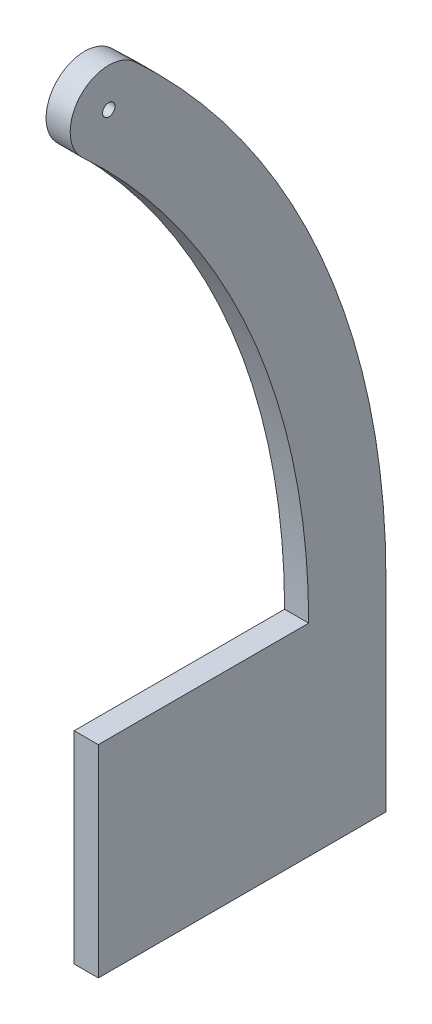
ISO-10303-21;
HEADER;
FILE_DESCRIPTION(('STEP AP214'),'2;1');
FILE_NAME('part.step','',(''),(''),'','','');
FILE_SCHEMA(('AUTOMOTIVE_DESIGN { 1 0 10303 214 1 1 1 1 }'));
ENDSEC;
DATA;
#1=APPLICATION_CONTEXT('core data for automotive mechanical design processes');
#2=APPLICATION_PROTOCOL_DEFINITION('international standard','automotive_design',2000,#1);
#3=PRODUCT_CONTEXT('',#1,'mechanical');
#4=PRODUCT('Part','Part','',(#3));
#5=PRODUCT_RELATED_PRODUCT_CATEGORY('part','',(#4));
#6=PRODUCT_DEFINITION_FORMATION('','',#4);
#7=PRODUCT_DEFINITION_CONTEXT('part definition',#1,'design');
#8=PRODUCT_DEFINITION('design','',#6,#7);
#9=PRODUCT_DEFINITION_SHAPE('','',#8);
#10=(LENGTH_UNIT() NAMED_UNIT(*) SI_UNIT(.MILLI.,.METRE.));
#11=(NAMED_UNIT(*) PLANE_ANGLE_UNIT() SI_UNIT($,.RADIAN.));
#12=(NAMED_UNIT(*) SI_UNIT($,.STERADIAN.) SOLID_ANGLE_UNIT());
#13=UNCERTAINTY_MEASURE_WITH_UNIT(LENGTH_MEASURE(1.E-05),#10,'distance_accuracy_value','');
#14=(GEOMETRIC_REPRESENTATION_CONTEXT(3) GLOBAL_UNCERTAINTY_ASSIGNED_CONTEXT((#13)) GLOBAL_UNIT_ASSIGNED_CONTEXT((#10,
#11,#12)) REPRESENTATION_CONTEXT('',''));
#15=CARTESIAN_POINT('',(0.,0.,0.));
#16=DIRECTION('',(0.,0.,1.));
#17=DIRECTION('',(1.,0.,0.));
#18=AXIS2_PLACEMENT_3D('',#15,#16,#17);
#19=CARTESIAN_POINT('',(6.2,52.,200.555112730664));
#20=DIRECTION('',(-1.,0.,0.));
#21=DIRECTION('',(0.,0.,1.));
#22=AXIS2_PLACEMENT_3D('',#19,#20,#21);
#23=PLANE('',#22);
#24=CARTESIAN_POINT('',(6.2,52.,200.555112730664));
#25=DIRECTION('',(1.,0.,0.));
#26=DIRECTION('',(0.,0.,1.));
#27=AXIS2_PLACEMENT_3D('',#24,#25,#26);
#28=CIRCLE('',#27,200.555112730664);
#29=CARTESIAN_POINT('',(6.2,52.,0.));
#30=VERTEX_POINT('',#29);
#31=CARTESIAN_POINT('',(6.2,199.405279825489,64.5623308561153));
#32=VERTEX_POINT('',#31);
#33=EDGE_CURVE('E138',#30,#32,#28,.T.);
#34=ORIENTED_EDGE('',*,*,#33,.T.);
#35=CARTESIAN_POINT('',(6.2,192.103857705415,71.2984579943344));
#36=DIRECTION('',(1.,0.,0.));
#37=DIRECTION('',(0.,0.,1.));
#38=AXIS2_PLACEMENT_3D('',#35,#36,#37);
#39=CIRCLE('',#38,9.9340914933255);
#40=CARTESIAN_POINT('',(6.2,184.802435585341,78.0345851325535));
#41=VERTEX_POINT('',#40);
#42=EDGE_CURVE('E91',#32,#41,#39,.T.);
#43=ORIENTED_EDGE('',*,*,#42,.T.);
#44=CARTESIAN_POINT('',(6.2,52.,200.555112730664));
#45=DIRECTION('',(-1.,0.,0.));
#46=DIRECTION('',(0.,0.,-1.));
#47=AXIS2_PLACEMENT_3D('',#44,#45,#46);
#48=CIRCLE('',#47,180.686929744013);
#49=CARTESIAN_POINT('',(6.2,52.,19.868182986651));
#50=VERTEX_POINT('',#49);
#51=EDGE_CURVE('E150',#41,#50,#48,.T.);
#52=ORIENTED_EDGE('',*,*,#51,.T.);
#53=DIRECTION('',(0.,0.,1.));
#54=VECTOR('',#53,1.);
#55=CARTESIAN_POINT('',(6.2,52.,74.));
#56=LINE('',#55,#54);
#57=CARTESIAN_POINT('',(6.2,52.,74.));
#58=VERTEX_POINT('',#57);
#59=EDGE_CURVE('E107',#50,#58,#56,.T.);
#60=ORIENTED_EDGE('',*,*,#59,.T.);
#61=DIRECTION('',(0.,-1.,0.));
#62=VECTOR('',#61,1.);
#63=CARTESIAN_POINT('',(6.2,0.,74.));
#64=LINE('',#63,#62);
#65=CARTESIAN_POINT('',(6.2,0.,74.));
#66=VERTEX_POINT('',#65);
#67=EDGE_CURVE('E101',#58,#66,#64,.T.);
#68=ORIENTED_EDGE('',*,*,#67,.T.);
#69=DIRECTION('',(0.,0.,-1.));
#70=VECTOR('',#69,1.);
#71=CARTESIAN_POINT('',(6.2,0.,0.));
#72=LINE('',#71,#70);
#73=CARTESIAN_POINT('',(6.2,0.,0.));
#74=VERTEX_POINT('',#73);
#75=EDGE_CURVE('E105',#66,#74,#72,.T.);
#76=ORIENTED_EDGE('',*,*,#75,.T.);
#77=DIRECTION('',(0.,1.,0.));
#78=VECTOR('',#77,1.);
#79=CARTESIAN_POINT('',(6.2,52.,0.));
#80=LINE('',#79,#78);
#81=EDGE_CURVE('E51',#74,#30,#80,.T.);
#82=ORIENTED_EDGE('',*,*,#81,.T.);
#83=EDGE_LOOP('',(#34,#43,#52,#60,#68,#76,#82));
#84=FACE_BOUND('',#83,.T.);
#85=CARTESIAN_POINT('',(6.2,192.103857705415,71.2984579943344));
#86=DIRECTION('',(1.,0.,0.));
#87=DIRECTION('',(0.,0.,-1.));
#88=AXIS2_PLACEMENT_3D('',#85,#86,#87);
#89=CIRCLE('',#88,1.6);
#90=CARTESIAN_POINT('',(6.2,192.103857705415,72.8984579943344));
#91=VERTEX_POINT('',#90);
#92=EDGE_CURVE('E129',#91,#91,#89,.T.);
#93=ORIENTED_EDGE('',*,*,#92,.F.);
#94=EDGE_LOOP('',(#93));
#95=FACE_BOUND('',#94,.T.);
#96=ADVANCED_FACE('F34',(#84,#95),#23,.F.);
#97=CARTESIAN_POINT('',(0.,52.,200.555112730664));
#98=DIRECTION('',(-1.,0.,0.));
#99=DIRECTION('',(0.,0.,1.));
#100=AXIS2_PLACEMENT_3D('',#97,#98,#99);
#101=PLANE('',#100);
#102=CARTESIAN_POINT('',(0.,52.,200.555112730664));
#103=DIRECTION('',(1.,0.,0.));
#104=DIRECTION('',(0.,0.,1.));
#105=AXIS2_PLACEMENT_3D('',#102,#103,#104);
#106=CIRCLE('',#105,200.555112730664);
#107=CARTESIAN_POINT('',(0.,52.,0.));
#108=VERTEX_POINT('',#107);
#109=CARTESIAN_POINT('',(0.,199.405279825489,64.5623308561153));
#110=VERTEX_POINT('',#109);
#111=EDGE_CURVE('E125',#108,#110,#106,.T.);
#112=ORIENTED_EDGE('',*,*,#111,.F.);
#113=DIRECTION('',(0.,1.,0.));
#114=VECTOR('',#113,1.);
#115=CARTESIAN_POINT('',(0.,52.,0.));
#116=LINE('',#115,#114);
#117=CARTESIAN_POINT('',(0.,0.,0.));
#118=VERTEX_POINT('',#117);
#119=EDGE_CURVE('E83',#118,#108,#116,.T.);
#120=ORIENTED_EDGE('',*,*,#119,.F.);
#121=DIRECTION('',(0.,0.,-1.));
#122=VECTOR('',#121,1.);
#123=CARTESIAN_POINT('',(0.,0.,0.));
#124=LINE('',#123,#122);
#125=CARTESIAN_POINT('',(0.,0.,74.));
#126=VERTEX_POINT('',#125);
#127=EDGE_CURVE('E77',#126,#118,#124,.T.);
#128=ORIENTED_EDGE('',*,*,#127,.F.);
#129=DIRECTION('',(0.,-1.,0.));
#130=VECTOR('',#129,1.);
#131=CARTESIAN_POINT('',(0.,0.,74.));
#132=LINE('',#131,#130);
#133=CARTESIAN_POINT('',(0.,52.,74.));
#134=VERTEX_POINT('',#133);
#135=EDGE_CURVE('E115',#134,#126,#132,.T.);
#136=ORIENTED_EDGE('',*,*,#135,.F.);
#137=DIRECTION('',(0.,0.,1.));
#138=VECTOR('',#137,1.);
#139=CARTESIAN_POINT('',(0.,52.,74.));
#140=LINE('',#139,#138);
#141=CARTESIAN_POINT('',(0.,52.,19.868182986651));
#142=VERTEX_POINT('',#141);
#143=EDGE_CURVE('E133',#142,#134,#140,.T.);
#144=ORIENTED_EDGE('',*,*,#143,.F.);
#145=CARTESIAN_POINT('',(0.,52.,200.555112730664));
#146=DIRECTION('',(-1.,0.,0.));
#147=DIRECTION('',(0.,0.,-1.));
#148=AXIS2_PLACEMENT_3D('',#145,#146,#147);
#149=CIRCLE('',#148,180.686929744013);
#150=CARTESIAN_POINT('',(0.,184.802435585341,78.0345851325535));
#151=VERTEX_POINT('',#150);
#152=EDGE_CURVE('E131',#151,#142,#149,.T.);
#153=ORIENTED_EDGE('',*,*,#152,.F.);
#154=CARTESIAN_POINT('',(0.,192.103857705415,71.2984579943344));
#155=DIRECTION('',(1.,0.,0.));
#156=DIRECTION('',(0.,0.,1.));
#157=AXIS2_PLACEMENT_3D('',#154,#155,#156);
#158=CIRCLE('',#157,9.9340914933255);
#159=EDGE_CURVE('E128',#110,#151,#158,.T.);
#160=ORIENTED_EDGE('',*,*,#159,.F.);
#161=EDGE_LOOP('',(#112,#120,#128,#136,#144,#153,#160));
#162=FACE_BOUND('',#161,.T.);
#163=CARTESIAN_POINT('',(0.,192.103857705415,71.2984579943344));
#164=DIRECTION('',(1.,0.,0.));
#165=DIRECTION('',(0.,0.,-1.));
#166=AXIS2_PLACEMENT_3D('',#163,#164,#165);
#167=CIRCLE('',#166,1.6);
#168=CARTESIAN_POINT('',(0.,192.103857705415,72.8984579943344));
#169=VERTEX_POINT('',#168);
#170=EDGE_CURVE('E162',#169,#169,#167,.T.);
#171=ORIENTED_EDGE('',*,*,#170,.T.);
#172=EDGE_LOOP('',(#171));
#173=FACE_BOUND('',#172,.T.);
#174=ADVANCED_FACE('F154',(#162,#173),#101,.T.);
#175=CARTESIAN_POINT('',(6.2,52.,200.555112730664));
#176=DIRECTION('',(-1.,0.,0.));
#177=DIRECTION('',(0.,0.,1.));
#178=AXIS2_PLACEMENT_3D('',#175,#176,#177);
#179=CYLINDRICAL_SURFACE('',#178,200.555112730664);
#180=ORIENTED_EDGE('',*,*,#111,.T.);
#181=DIRECTION('',(-1.,0.,0.));
#182=VECTOR('',#181,1.);
#183=CARTESIAN_POINT('',(6.2,199.405279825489,64.5623308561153));
#184=LINE('',#183,#182);
#185=EDGE_CURVE('E11',#32,#110,#184,.T.);
#186=ORIENTED_EDGE('',*,*,#185,.F.);
#187=ORIENTED_EDGE('',*,*,#33,.F.);
#188=DIRECTION('',(-1.,0.,0.));
#189=VECTOR('',#188,1.);
#190=CARTESIAN_POINT('',(6.2,52.,0.));
#191=LINE('',#190,#189);
#192=EDGE_CURVE('E121',#30,#108,#191,.T.);
#193=ORIENTED_EDGE('',*,*,#192,.T.);
#194=EDGE_LOOP('',(#180,#186,#187,#193));
#195=FACE_BOUND('',#194,.T.);
#196=ADVANCED_FACE('F36',(#195),#179,.T.);
#197=CARTESIAN_POINT('',(6.2,192.103857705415,71.2984579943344));
#198=DIRECTION('',(-1.,0.,0.));
#199=DIRECTION('',(0.,0.,1.));
#200=AXIS2_PLACEMENT_3D('',#197,#198,#199);
#201=CYLINDRICAL_SURFACE('',#200,9.9340914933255);
#202=ORIENTED_EDGE('',*,*,#159,.T.);
#203=DIRECTION('',(-1.,0.,0.));
#204=VECTOR('',#203,1.);
#205=CARTESIAN_POINT('',(6.2,184.802435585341,78.0345851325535));
#206=LINE('',#205,#204);
#207=EDGE_CURVE('E43',#41,#151,#206,.T.);
#208=ORIENTED_EDGE('',*,*,#207,.F.);
#209=ORIENTED_EDGE('',*,*,#42,.F.);
#210=ORIENTED_EDGE('',*,*,#185,.T.);
#211=EDGE_LOOP('',(#202,#208,#209,#210));
#212=FACE_BOUND('',#211,.T.);
#213=ADVANCED_FACE('F188',(#212),#201,.T.);
#214=CARTESIAN_POINT('',(6.2,52.,200.555112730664));
#215=DIRECTION('',(-1.,0.,0.));
#216=DIRECTION('',(0.,0.,1.));
#217=AXIS2_PLACEMENT_3D('',#214,#215,#216);
#218=CYLINDRICAL_SURFACE('',#217,180.686929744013);
#219=ORIENTED_EDGE('',*,*,#152,.T.);
#220=DIRECTION('',(-1.,0.,0.));
#221=VECTOR('',#220,1.);
#222=CARTESIAN_POINT('',(6.2,52.,19.868182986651));
#223=LINE('',#222,#221);
#224=EDGE_CURVE('E142',#50,#142,#223,.T.);
#225=ORIENTED_EDGE('',*,*,#224,.F.);
#226=ORIENTED_EDGE('',*,*,#51,.F.);
#227=ORIENTED_EDGE('',*,*,#207,.T.);
#228=EDGE_LOOP('',(#219,#225,#226,#227));
#229=FACE_BOUND('',#228,.T.);
#230=ADVANCED_FACE('F148',(#229),#218,.F.);
#231=CARTESIAN_POINT('',(6.2,52.,74.));
#232=DIRECTION('',(0.,-1.,0.));
#233=DIRECTION('',(0.,0.,-1.));
#234=AXIS2_PLACEMENT_3D('',#231,#232,#233);
#235=PLANE('',#234);
#236=ORIENTED_EDGE('',*,*,#143,.T.);
#237=DIRECTION('',(-1.,0.,0.));
#238=VECTOR('',#237,1.);
#239=CARTESIAN_POINT('',(6.2,52.,74.));
#240=LINE('',#239,#238);
#241=EDGE_CURVE('E116',#58,#134,#240,.T.);
#242=ORIENTED_EDGE('',*,*,#241,.F.);
#243=ORIENTED_EDGE('',*,*,#59,.F.);
#244=ORIENTED_EDGE('',*,*,#224,.T.);
#245=EDGE_LOOP('',(#236,#242,#243,#244));
#246=FACE_BOUND('',#245,.T.);
#247=ADVANCED_FACE('F157',(#246),#235,.F.);
#248=CARTESIAN_POINT('',(6.2,0.,74.));
#249=DIRECTION('',(0.,0.,-1.));
#250=DIRECTION('',(-1.,0.,0.));
#251=AXIS2_PLACEMENT_3D('',#248,#249,#250);
#252=PLANE('',#251);
#253=ORIENTED_EDGE('',*,*,#135,.T.);
#254=DIRECTION('',(-1.,0.,0.));
#255=VECTOR('',#254,1.);
#256=CARTESIAN_POINT('',(6.2,0.,74.));
#257=LINE('',#256,#255);
#258=EDGE_CURVE('E112',#66,#126,#257,.T.);
#259=ORIENTED_EDGE('',*,*,#258,.F.);
#260=ORIENTED_EDGE('',*,*,#67,.F.);
#261=ORIENTED_EDGE('',*,*,#241,.T.);
#262=EDGE_LOOP('',(#253,#259,#260,#261));
#263=FACE_BOUND('',#262,.T.);
#264=ADVANCED_FACE('F113',(#263),#252,.F.);
#265=CARTESIAN_POINT('',(6.2,0.,0.));
#266=DIRECTION('',(0.,1.,0.));
#267=DIRECTION('',(0.,0.,1.));
#268=AXIS2_PLACEMENT_3D('',#265,#266,#267);
#269=PLANE('',#268);
#270=ORIENTED_EDGE('',*,*,#127,.T.);
#271=DIRECTION('',(-1.,0.,0.));
#272=VECTOR('',#271,1.);
#273=CARTESIAN_POINT('',(6.2,0.,0.));
#274=LINE('',#273,#272);
#275=EDGE_CURVE('E117',#74,#118,#274,.T.);
#276=ORIENTED_EDGE('',*,*,#275,.F.);
#277=ORIENTED_EDGE('',*,*,#75,.F.);
#278=ORIENTED_EDGE('',*,*,#258,.T.);
#279=EDGE_LOOP('',(#270,#276,#277,#278));
#280=FACE_BOUND('',#279,.T.);
#281=ADVANCED_FACE('F119',(#280),#269,.F.);
#282=CARTESIAN_POINT('',(6.2,52.,0.));
#283=DIRECTION('',(0.,0.,1.));
#284=DIRECTION('',(0.,-1.,0.));
#285=AXIS2_PLACEMENT_3D('',#282,#283,#284);
#286=PLANE('',#285);
#287=ORIENTED_EDGE('',*,*,#119,.T.);
#288=ORIENTED_EDGE('',*,*,#192,.F.);
#289=ORIENTED_EDGE('',*,*,#81,.F.);
#290=ORIENTED_EDGE('',*,*,#275,.T.);
#291=EDGE_LOOP('',(#287,#288,#289,#290));
#292=FACE_BOUND('',#291,.T.);
#293=ADVANCED_FACE('F178',(#292),#286,.F.);
#294=CARTESIAN_POINT('',(6.2,192.103857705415,71.2984579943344));
#295=DIRECTION('',(-1.,0.,0.));
#296=DIRECTION('',(0.,0.,1.));
#297=AXIS2_PLACEMENT_3D('',#294,#295,#296);
#298=CYLINDRICAL_SURFACE('',#297,1.6);
#299=CARTESIAN_POINT('',(6.2,192.103857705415,72.8984579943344));
#300=CARTESIAN_POINT('',(6.13541666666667,192.103857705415,72.8984579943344));
#301=CARTESIAN_POINT('',(6.07083333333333,192.103857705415,72.8984579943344));
#302=CARTESIAN_POINT('',(5.94166666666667,192.103857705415,72.8984579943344));
#303=CARTESIAN_POINT('',(5.87708333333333,192.103857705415,72.8984579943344));
#304=CARTESIAN_POINT('',(5.74791666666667,192.103857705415,72.8984579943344));
#305=CARTESIAN_POINT('',(5.68333333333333,192.103857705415,72.8984579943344));
#306=CARTESIAN_POINT('',(5.55416666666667,192.103857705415,72.8984579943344));
#307=CARTESIAN_POINT('',(5.48958333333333,192.103857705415,72.8984579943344));
#308=CARTESIAN_POINT('',(5.36041666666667,192.103857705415,72.8984579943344));
#309=CARTESIAN_POINT('',(5.29583333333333,192.103857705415,72.8984579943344));
#310=CARTESIAN_POINT('',(5.16666666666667,192.103857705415,72.8984579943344));
#311=CARTESIAN_POINT('',(5.10208333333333,192.103857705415,72.8984579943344));
#312=CARTESIAN_POINT('',(4.97291666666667,192.103857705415,72.8984579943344));
#313=CARTESIAN_POINT('',(4.90833333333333,192.103857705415,72.8984579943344));
#314=CARTESIAN_POINT('',(4.77916666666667,192.103857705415,72.8984579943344));
#315=CARTESIAN_POINT('',(4.71458333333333,192.103857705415,72.8984579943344));
#316=CARTESIAN_POINT('',(4.58541666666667,192.103857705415,72.8984579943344));
#317=CARTESIAN_POINT('',(4.52083333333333,192.103857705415,72.8984579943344));
#318=CARTESIAN_POINT('',(4.39166666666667,192.103857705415,72.8984579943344));
#319=CARTESIAN_POINT('',(4.32708333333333,192.103857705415,72.8984579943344));
#320=CARTESIAN_POINT('',(4.19791666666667,192.103857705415,72.8984579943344));
#321=CARTESIAN_POINT('',(4.13333333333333,192.103857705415,72.8984579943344));
#322=CARTESIAN_POINT('',(4.00416666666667,192.103857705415,72.8984579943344));
#323=CARTESIAN_POINT('',(3.93958333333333,192.103857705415,72.8984579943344));
#324=CARTESIAN_POINT('',(3.81041666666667,192.103857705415,72.8984579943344));
#325=CARTESIAN_POINT('',(3.74583333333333,192.103857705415,72.8984579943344));
#326=CARTESIAN_POINT('',(3.61666666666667,192.103857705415,72.8984579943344));
#327=CARTESIAN_POINT('',(3.55208333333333,192.103857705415,72.8984579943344));
#328=CARTESIAN_POINT('',(3.42291666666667,192.103857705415,72.8984579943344));
#329=CARTESIAN_POINT('',(3.35833333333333,192.103857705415,72.8984579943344));
#330=CARTESIAN_POINT('',(3.22916666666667,192.103857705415,72.8984579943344));
#331=CARTESIAN_POINT('',(3.16458333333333,192.103857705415,72.8984579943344));
#332=CARTESIAN_POINT('',(3.03541666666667,192.103857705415,72.8984579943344));
#333=CARTESIAN_POINT('',(2.97083333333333,192.103857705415,72.8984579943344));
#334=CARTESIAN_POINT('',(2.84166666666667,192.103857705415,72.8984579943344));
#335=CARTESIAN_POINT('',(2.77708333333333,192.103857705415,72.8984579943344));
#336=CARTESIAN_POINT('',(2.64791666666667,192.103857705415,72.8984579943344));
#337=CARTESIAN_POINT('',(2.58333333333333,192.103857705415,72.8984579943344));
#338=CARTESIAN_POINT('',(2.45416666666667,192.103857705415,72.8984579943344));
#339=CARTESIAN_POINT('',(2.38958333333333,192.103857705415,72.8984579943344));
#340=CARTESIAN_POINT('',(2.26041666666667,192.103857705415,72.8984579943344));
#341=CARTESIAN_POINT('',(2.19583333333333,192.103857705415,72.8984579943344));
#342=CARTESIAN_POINT('',(2.06666666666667,192.103857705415,72.8984579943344));
#343=CARTESIAN_POINT('',(2.00208333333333,192.103857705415,72.8984579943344));
#344=CARTESIAN_POINT('',(1.87291666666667,192.103857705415,72.8984579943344));
#345=CARTESIAN_POINT('',(1.80833333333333,192.103857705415,72.8984579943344));
#346=CARTESIAN_POINT('',(1.67916666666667,192.103857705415,72.8984579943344));
#347=CARTESIAN_POINT('',(1.61458333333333,192.103857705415,72.8984579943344));
#348=CARTESIAN_POINT('',(1.48541666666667,192.103857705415,72.8984579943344));
#349=CARTESIAN_POINT('',(1.42083333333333,192.103857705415,72.8984579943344));
#350=CARTESIAN_POINT('',(1.29166666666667,192.103857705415,72.8984579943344));
#351=CARTESIAN_POINT('',(1.22708333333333,192.103857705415,72.8984579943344));
#352=CARTESIAN_POINT('',(1.09791666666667,192.103857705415,72.8984579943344));
#353=CARTESIAN_POINT('',(1.03333333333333,192.103857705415,72.8984579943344));
#354=CARTESIAN_POINT('',(0.904166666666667,192.103857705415,72.8984579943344));
#355=CARTESIAN_POINT('',(0.839583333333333,192.103857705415,72.8984579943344));
#356=CARTESIAN_POINT('',(0.710416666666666,192.103857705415,72.8984579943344));
#357=CARTESIAN_POINT('',(0.645833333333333,192.103857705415,72.8984579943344));
#358=CARTESIAN_POINT('',(0.516666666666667,192.103857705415,72.8984579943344));
#359=CARTESIAN_POINT('',(0.452083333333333,192.103857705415,72.8984579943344));
#360=CARTESIAN_POINT('',(0.322916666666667,192.103857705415,72.8984579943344));
#361=CARTESIAN_POINT('',(0.258333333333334,192.103857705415,72.8984579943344));
#362=CARTESIAN_POINT('',(0.129166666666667,192.103857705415,72.8984579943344));
#363=CARTESIAN_POINT('',(0.0645833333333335,192.103857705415,72.8984579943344));
#364=CARTESIAN_POINT('',(0.,192.103857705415,72.8984579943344));
#365=B_SPLINE_CURVE_WITH_KNOTS('',3,(#299,#300,#301,#302,#303,#304,#305,#306,#307,#308,#309,
#310,#311,#312,#313,#314,#315,#316,#317,#318,#319,#320,#321,#322,#323,#324,#325,#326,#327,#328,
#329,#330,#331,#332,#333,#334,#335,#336,#337,#338,#339,#340,#341,#342,#343,#344,#345,#346,#347,
#348,#349,#350,#351,#352,#353,#354,#355,#356,#357,#358,#359,#360,#361,#362,#363,#364),
.UNSPECIFIED.,.F.,.F.,(4,2,2,2,2,2,2,2,2,2,2,2,2,2,2,2,2,2,2,2,2,2,2,2,2,2,2,2,2,2,2,2,4),(0.,
0.193749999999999,0.3875,0.581249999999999,0.775,0.968749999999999,1.1625,1.35625,1.55,1.74375,
1.9375,2.13125,2.325,2.51875,2.7125,2.90625,3.1,3.29375,3.4875,3.68125,3.875,4.06875,4.2625,
4.45625,4.65,4.84375,5.0375,5.23125,5.425,5.61875,5.8125,6.00625,6.2),.UNSPECIFIED.);
#366=EDGE_CURVE('BSEAM168',#91,#169,#365,.T.);
#367=ORIENTED_EDGE('',*,*,#92,.T.);
#368=ORIENTED_EDGE('',*,*,#170,.F.);
#369=ORIENTED_EDGE('',*,*,#366,.T.);
#370=ORIENTED_EDGE('',*,*,#366,.F.);
#371=EDGE_LOOP('',(#367,#369,#368,#370));
#372=FACE_BOUND('',#371,.T.);
#373=ADVANCED_FACE('F168',(#372),#298,.F.);
#374=CLOSED_SHELL('',(#96,#174,#196,#213,#230,#247,#264,#281,#293,#373));
#375=MANIFOLD_SOLID_BREP('B2',#374);
#376=ADVANCED_BREP_SHAPE_REPRESENTATION('',(#18,#375),#14);
#377=SHAPE_DEFINITION_REPRESENTATION(#9,#376);
ENDSEC;
END-ISO-10303-21;
